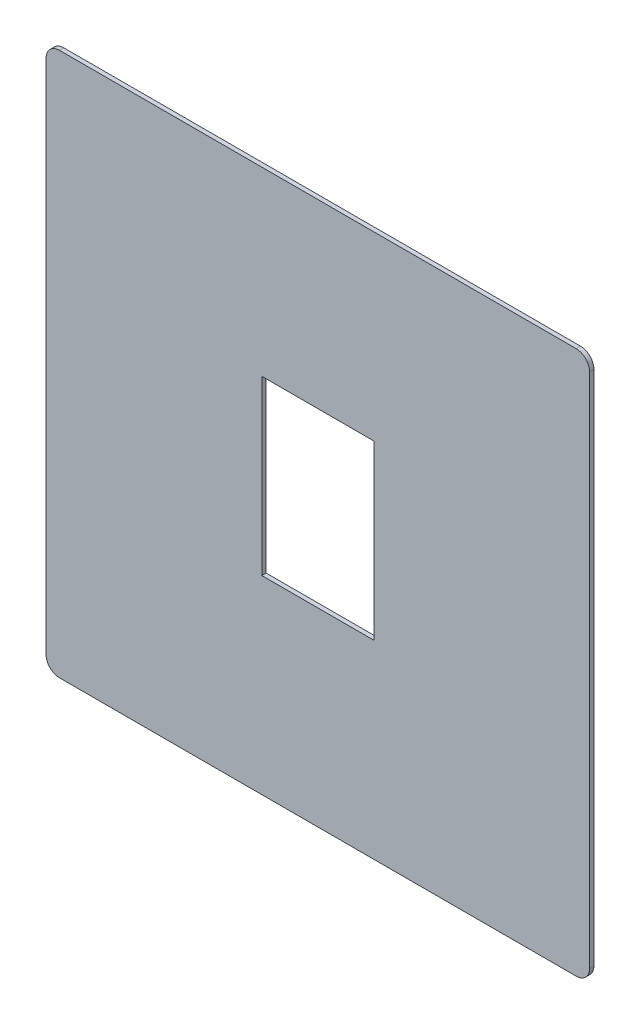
from build123d import *

# Parameters (mm, degrees)
ESQUISSE1_W          = 13
ESQUISSE1_H          = 20
BASE_EXTRUSION_DEPTH = 0.5


with BuildPart() as part:
    # Esquisse1 → Base-Extrusion (new body)
    with BuildSketch(Plane.XY):
        with BuildLine():
            Line((29.949747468, 31), (-29.949747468, 31))
            ThreePointArc((-29.949747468, 31), (-31.045941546, 30.545941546), (-31.5, 29.449747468))
            Line((-31.5, 29.449747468), (-31.5, -30.449747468))
            ThreePointArc((-31.5, -30.449747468), (-31.045941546, -31.545941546), (-29.949747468, -32))
            Line((-29.949747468, -32), (29.949747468, -32))
            ThreePointArc((29.949747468, -32), (31.045941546, -31.545941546), (31.5, -30.449747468))
            Line((31.5, -30.449747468), (31.5, 29.449747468))
            ThreePointArc((31.5, 29.449747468), (31.045941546, 30.545941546), (29.949747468, 31))
        make_face()
        Rectangle(ESQUISSE1_W, ESQUISSE1_H, mode=Mode.SUBTRACT)
    extrude(amount=BASE_EXTRUSION_DEPTH)


solid = part.part
